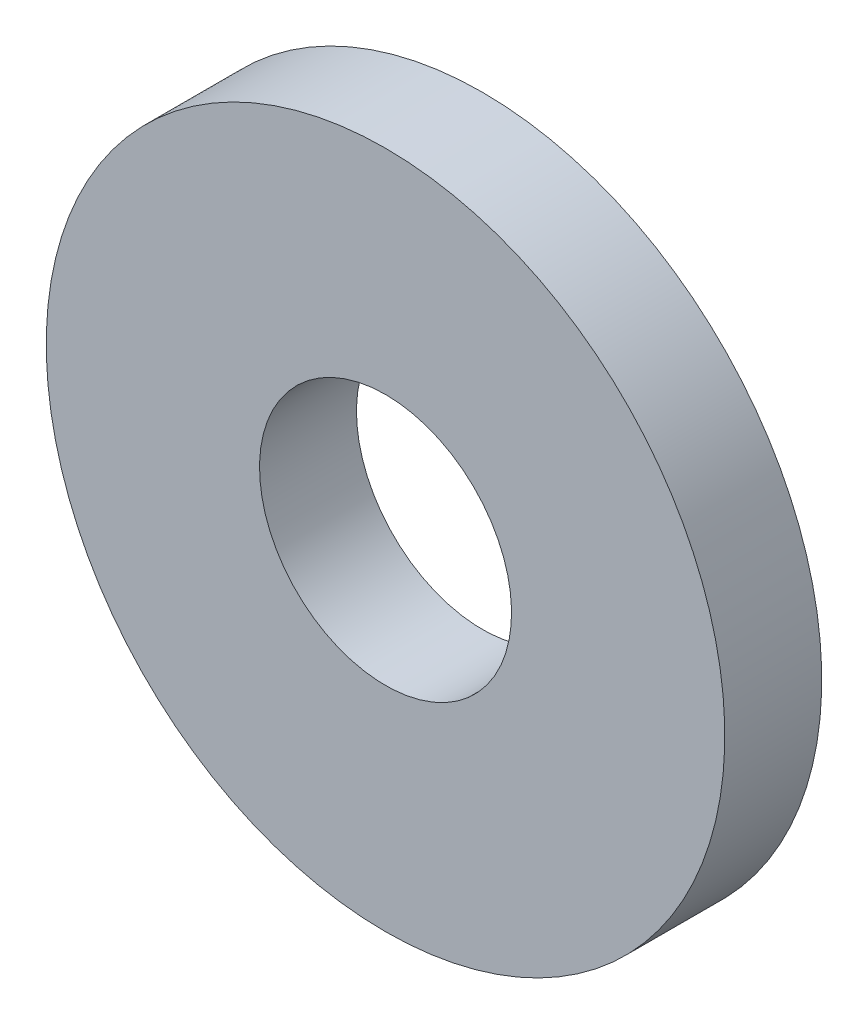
ISO-10303-21;
HEADER;
FILE_DESCRIPTION(('STEP AP214'),'2;1');
FILE_NAME('part.step','',(''),(''),'','','');
FILE_SCHEMA(('AUTOMOTIVE_DESIGN { 1 0 10303 214 1 1 1 1 }'));
ENDSEC;
DATA;
#1=APPLICATION_CONTEXT('core data for automotive mechanical design processes');
#2=APPLICATION_PROTOCOL_DEFINITION('international standard','automotive_design',2000,#1);
#3=PRODUCT_CONTEXT('',#1,'mechanical');
#4=PRODUCT('Part','Part','',(#3));
#5=PRODUCT_RELATED_PRODUCT_CATEGORY('part','',(#4));
#6=PRODUCT_DEFINITION_FORMATION('','',#4);
#7=PRODUCT_DEFINITION_CONTEXT('part definition',#1,'design');
#8=PRODUCT_DEFINITION('design','',#6,#7);
#9=PRODUCT_DEFINITION_SHAPE('','',#8);
#10=(LENGTH_UNIT() NAMED_UNIT(*) SI_UNIT(.MILLI.,.METRE.));
#11=(NAMED_UNIT(*) PLANE_ANGLE_UNIT() SI_UNIT($,.RADIAN.));
#12=(NAMED_UNIT(*) SI_UNIT($,.STERADIAN.) SOLID_ANGLE_UNIT());
#13=UNCERTAINTY_MEASURE_WITH_UNIT(LENGTH_MEASURE(1.E-05),#10,'distance_accuracy_value','');
#14=(GEOMETRIC_REPRESENTATION_CONTEXT(3) GLOBAL_UNCERTAINTY_ASSIGNED_CONTEXT((#13)) GLOBAL_UNIT_ASSIGNED_CONTEXT((#10,
#11,#12)) REPRESENTATION_CONTEXT('',''));
#15=CARTESIAN_POINT('',(0.,0.,0.));
#16=DIRECTION('',(0.,0.,1.));
#17=DIRECTION('',(1.,0.,0.));
#18=AXIS2_PLACEMENT_3D('',#15,#16,#17);
#19=CARTESIAN_POINT('',(0.,0.,0.));
#20=DIRECTION('',(0.,0.,-1.));
#21=DIRECTION('',(0.,1.,0.));
#22=AXIS2_PLACEMENT_3D('',#19,#20,#21);
#23=PLANE('',#22);
#24=CARTESIAN_POINT('',(0.,0.,0.));
#25=DIRECTION('',(0.,0.,-1.));
#26=DIRECTION('',(0.,1.,0.));
#27=AXIS2_PLACEMENT_3D('',#24,#25,#26);
#28=CIRCLE('',#27,7.);
#29=CARTESIAN_POINT('',(0.,7.,0.));
#30=VERTEX_POINT('',#29);
#31=EDGE_CURVE('E8',#30,#30,#28,.T.);
#32=ORIENTED_EDGE('',*,*,#31,.T.);
#33=EDGE_LOOP('',(#32));
#34=FACE_BOUND('',#33,.T.);
#35=CARTESIAN_POINT('',(0.,0.,0.));
#36=DIRECTION('',(0.,0.,-1.));
#37=DIRECTION('',(0.,1.,0.));
#38=AXIS2_PLACEMENT_3D('',#35,#36,#37);
#39=CIRCLE('',#38,2.6);
#40=CARTESIAN_POINT('',(0.,2.6,0.));
#41=VERTEX_POINT('',#40);
#42=EDGE_CURVE('E23',#41,#41,#39,.T.);
#43=ORIENTED_EDGE('',*,*,#42,.F.);
#44=EDGE_LOOP('',(#43));
#45=FACE_BOUND('',#44,.T.);
#46=ADVANCED_FACE('F12',(#34,#45),#23,.T.);
#47=CARTESIAN_POINT('',(0.,0.,2.));
#48=DIRECTION('',(0.,0.,-1.));
#49=DIRECTION('',(0.,1.,0.));
#50=AXIS2_PLACEMENT_3D('',#47,#48,#49);
#51=PLANE('',#50);
#52=CARTESIAN_POINT('',(0.,0.,2.));
#53=DIRECTION('',(0.,0.,-1.));
#54=DIRECTION('',(0.,1.,0.));
#55=AXIS2_PLACEMENT_3D('',#52,#53,#54);
#56=CIRCLE('',#55,7.);
#57=CARTESIAN_POINT('',(0.,7.,2.));
#58=VERTEX_POINT('',#57);
#59=EDGE_CURVE('E19',#58,#58,#56,.T.);
#60=ORIENTED_EDGE('',*,*,#59,.F.);
#61=EDGE_LOOP('',(#60));
#62=FACE_BOUND('',#61,.T.);
#63=CARTESIAN_POINT('',(0.,0.,2.));
#64=DIRECTION('',(0.,0.,-1.));
#65=DIRECTION('',(0.,1.,0.));
#66=AXIS2_PLACEMENT_3D('',#63,#64,#65);
#67=CIRCLE('',#66,2.6);
#68=CARTESIAN_POINT('',(0.,2.6,2.));
#69=VERTEX_POINT('',#68);
#70=EDGE_CURVE('E27',#69,#69,#67,.T.);
#71=ORIENTED_EDGE('',*,*,#70,.T.);
#72=EDGE_LOOP('',(#71));
#73=FACE_BOUND('',#72,.T.);
#74=ADVANCED_FACE('F33',(#62,#73),#51,.F.);
#75=CARTESIAN_POINT('',(0.,0.,0.));
#76=DIRECTION('',(0.,0.,1.));
#77=DIRECTION('',(0.,-1.,0.));
#78=AXIS2_PLACEMENT_3D('',#75,#76,#77);
#79=CYLINDRICAL_SURFACE('',#78,7.);
#80=ORIENTED_EDGE('',*,*,#31,.F.);
#81=EDGE_LOOP('',(#80));
#82=FACE_BOUND('',#81,.T.);
#83=ORIENTED_EDGE('',*,*,#59,.T.);
#84=EDGE_LOOP('',(#83));
#85=FACE_BOUND('',#84,.T.);
#86=ADVANCED_FACE('F14',(#82,#85),#79,.T.);
#87=CARTESIAN_POINT('',(0.,0.,0.));
#88=DIRECTION('',(0.,0.,1.));
#89=DIRECTION('',(0.,-1.,0.));
#90=AXIS2_PLACEMENT_3D('',#87,#88,#89);
#91=CYLINDRICAL_SURFACE('',#90,2.6);
#92=ORIENTED_EDGE('',*,*,#42,.T.);
#93=EDGE_LOOP('',(#92));
#94=FACE_BOUND('',#93,.T.);
#95=ORIENTED_EDGE('',*,*,#70,.F.);
#96=EDGE_LOOP('',(#95));
#97=FACE_BOUND('',#96,.T.);
#98=ADVANCED_FACE('F35',(#94,#97),#91,.F.);
#99=CLOSED_SHELL('',(#46,#74,#86,#98));
#100=MANIFOLD_SOLID_BREP('B1',#99);
#101=ADVANCED_BREP_SHAPE_REPRESENTATION('',(#18,#100),#14);
#102=SHAPE_DEFINITION_REPRESENTATION(#9,#101);
ENDSEC;
END-ISO-10303-21;
